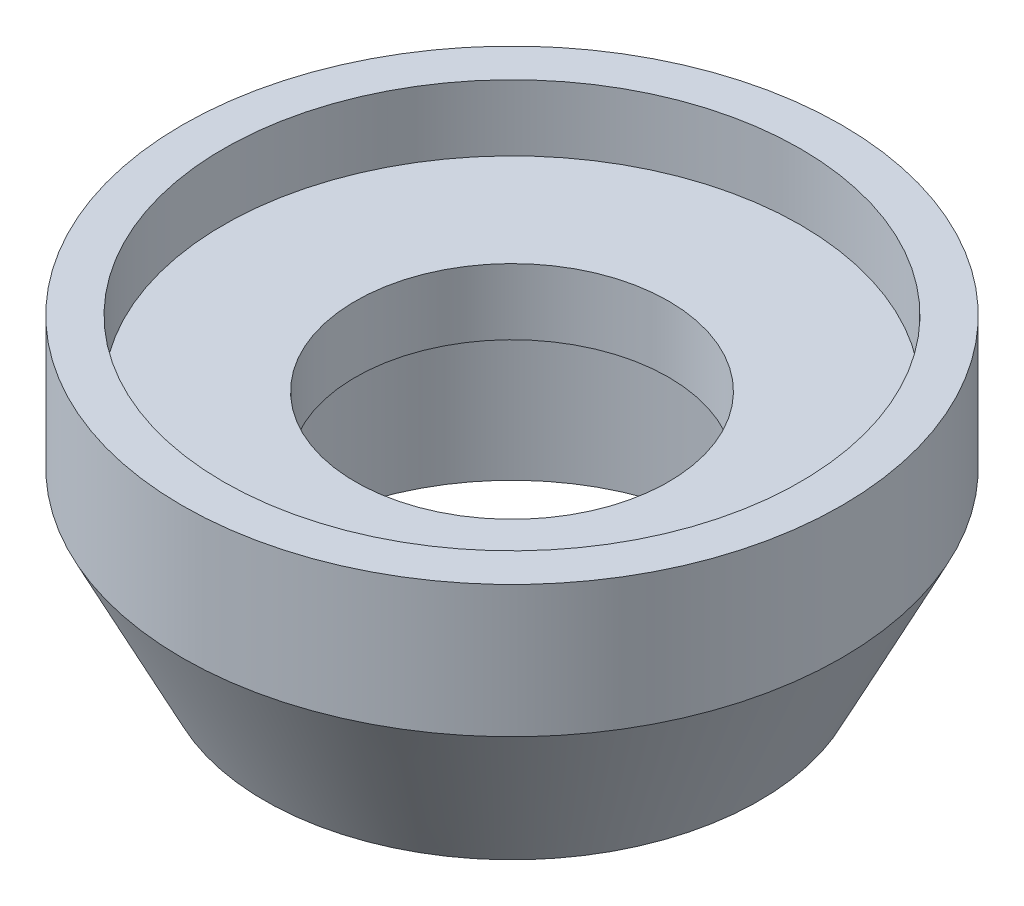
ISO-10303-21;
HEADER;
FILE_DESCRIPTION(('STEP AP214'),'2;1');
FILE_NAME('part.step','',(''),(''),'','','');
FILE_SCHEMA(('AUTOMOTIVE_DESIGN { 1 0 10303 214 1 1 1 1 }'));
ENDSEC;
DATA;
#1=APPLICATION_CONTEXT('core data for automotive mechanical design processes');
#2=APPLICATION_PROTOCOL_DEFINITION('international standard','automotive_design',2000,#1);
#3=PRODUCT_CONTEXT('',#1,'mechanical');
#4=PRODUCT('Part','Part','',(#3));
#5=PRODUCT_RELATED_PRODUCT_CATEGORY('part','',(#4));
#6=PRODUCT_DEFINITION_FORMATION('','',#4);
#7=PRODUCT_DEFINITION_CONTEXT('part definition',#1,'design');
#8=PRODUCT_DEFINITION('design','',#6,#7);
#9=PRODUCT_DEFINITION_SHAPE('','',#8);
#10=(LENGTH_UNIT() NAMED_UNIT(*) SI_UNIT(.MILLI.,.METRE.));
#11=(NAMED_UNIT(*) PLANE_ANGLE_UNIT() SI_UNIT($,.RADIAN.));
#12=(NAMED_UNIT(*) SI_UNIT($,.STERADIAN.) SOLID_ANGLE_UNIT());
#13=UNCERTAINTY_MEASURE_WITH_UNIT(LENGTH_MEASURE(1.E-05),#10,'distance_accuracy_value','');
#14=(GEOMETRIC_REPRESENTATION_CONTEXT(3) GLOBAL_UNCERTAINTY_ASSIGNED_CONTEXT((#13)) GLOBAL_UNIT_ASSIGNED_CONTEXT((#10,
#11,#12)) REPRESENTATION_CONTEXT('',''));
#15=CARTESIAN_POINT('',(0.,0.,0.));
#16=DIRECTION('',(0.,0.,1.));
#17=DIRECTION('',(1.,0.,0.));
#18=AXIS2_PLACEMENT_3D('',#15,#16,#17);
#19=CARTESIAN_POINT('',(-15.,7.67703485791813,0.));
#20=DIRECTION('',(0.,1.,0.));
#21=DIRECTION('',(0.,0.,1.));
#22=AXIS2_PLACEMENT_3D('',#19,#20,#21);
#23=PLANE('',#22);
#24=CARTESIAN_POINT('',(0.,7.67703485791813,0.));
#25=DIRECTION('',(0.,-1.,0.));
#26=DIRECTION('',(0.,0.,-1.));
#27=AXIS2_PLACEMENT_3D('',#24,#25,#26);
#28=CIRCLE('',#27,13.2);
#29=CARTESIAN_POINT('',(0.,7.67703485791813,-13.2));
#30=VERTEX_POINT('',#29);
#31=EDGE_CURVE('E10',#30,#30,#28,.T.);
#32=ORIENTED_EDGE('',*,*,#31,.F.);
#33=EDGE_LOOP('',(#32));
#34=FACE_BOUND('',#33,.T.);
#35=CARTESIAN_POINT('',(0.,7.67703485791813,0.));
#36=DIRECTION('',(0.,-1.,0.));
#37=DIRECTION('',(0.,0.,-1.));
#38=AXIS2_PLACEMENT_3D('',#35,#36,#37);
#39=CIRCLE('',#38,15.);
#40=CARTESIAN_POINT('',(0.,7.67703485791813,-15.));
#41=VERTEX_POINT('',#40);
#42=EDGE_CURVE('E62',#41,#41,#39,.T.);
#43=ORIENTED_EDGE('',*,*,#42,.T.);
#44=EDGE_LOOP('',(#43));
#45=FACE_BOUND('',#44,.T.);
#46=ADVANCED_FACE('F31',(#34,#45),#23,.F.);
#47=CARTESIAN_POINT('',(0.,0.,0.));
#48=DIRECTION('',(0.,-1.,0.));
#49=DIRECTION('',(0.,0.,-1.));
#50=AXIS2_PLACEMENT_3D('',#47,#48,#49);
#51=CYLINDRICAL_SURFACE('',#50,13.2);
#52=CARTESIAN_POINT('',(0.,17.6770348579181,0.));
#53=DIRECTION('',(0.,-1.,0.));
#54=DIRECTION('',(0.,0.,-1.));
#55=AXIS2_PLACEMENT_3D('',#52,#53,#54);
#56=CIRCLE('',#55,13.2);
#57=CARTESIAN_POINT('',(0.,17.6770348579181,-13.2));
#58=VERTEX_POINT('',#57);
#59=EDGE_CURVE('E37',#58,#58,#56,.T.);
#60=ORIENTED_EDGE('',*,*,#59,.F.);
#61=EDGE_LOOP('',(#60));
#62=FACE_BOUND('',#61,.T.);
#63=ORIENTED_EDGE('',*,*,#31,.T.);
#64=EDGE_LOOP('',(#63));
#65=FACE_BOUND('',#64,.T.);
#66=ADVANCED_FACE('F105',(#62,#65),#51,.F.);
#67=CARTESIAN_POINT('',(-13.2,17.6770348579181,0.));
#68=DIRECTION('',(0.,1.,0.));
#69=DIRECTION('',(0.,0.,1.));
#70=AXIS2_PLACEMENT_3D('',#67,#68,#69);
#71=PLANE('',#70);
#72=CARTESIAN_POINT('',(0.,17.6770348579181,0.));
#73=DIRECTION('',(0.,-1.,0.));
#74=DIRECTION('',(0.,0.,-1.));
#75=AXIS2_PLACEMENT_3D('',#72,#73,#74);
#76=CIRCLE('',#75,9.5);
#77=CARTESIAN_POINT('',(0.,17.6770348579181,-9.5));
#78=VERTEX_POINT('',#77);
#79=EDGE_CURVE('E41',#78,#78,#76,.T.);
#80=ORIENTED_EDGE('',*,*,#79,.F.);
#81=EDGE_LOOP('',(#80));
#82=FACE_BOUND('',#81,.T.);
#83=ORIENTED_EDGE('',*,*,#59,.T.);
#84=EDGE_LOOP('',(#83));
#85=FACE_BOUND('',#84,.T.);
#86=ADVANCED_FACE('F100',(#82,#85),#71,.F.);
#87=CARTESIAN_POINT('',(0.,0.,0.));
#88=DIRECTION('',(0.,-1.,0.));
#89=DIRECTION('',(0.,0.,-1.));
#90=AXIS2_PLACEMENT_3D('',#87,#88,#89);
#91=CYLINDRICAL_SURFACE('',#90,9.5);
#92=CARTESIAN_POINT('',(0.,21.6770348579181,0.));
#93=DIRECTION('',(0.,-1.,0.));
#94=DIRECTION('',(0.,0.,-1.));
#95=AXIS2_PLACEMENT_3D('',#92,#93,#94);
#96=CIRCLE('',#95,9.5);
#97=CARTESIAN_POINT('',(0.,21.6770348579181,-9.5));
#98=VERTEX_POINT('',#97);
#99=EDGE_CURVE('E45',#98,#98,#96,.T.);
#100=ORIENTED_EDGE('',*,*,#99,.F.);
#101=EDGE_LOOP('',(#100));
#102=FACE_BOUND('',#101,.T.);
#103=ORIENTED_EDGE('',*,*,#79,.T.);
#104=EDGE_LOOP('',(#103));
#105=FACE_BOUND('',#104,.T.);
#106=ADVANCED_FACE('F94',(#102,#105),#91,.F.);
#107=CARTESIAN_POINT('',(-9.5,21.6770348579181,0.));
#108=DIRECTION('',(0.,-1.,0.));
#109=DIRECTION('',(0.,0.,-1.));
#110=AXIS2_PLACEMENT_3D('',#107,#108,#109);
#111=PLANE('',#110);
#112=CARTESIAN_POINT('',(0.,21.6770348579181,0.));
#113=DIRECTION('',(0.,-1.,0.));
#114=DIRECTION('',(0.,0.,-1.));
#115=AXIS2_PLACEMENT_3D('',#112,#113,#114);
#116=CIRCLE('',#115,17.5);
#117=CARTESIAN_POINT('',(0.,21.6770348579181,-17.5));
#118=VERTEX_POINT('',#117);
#119=EDGE_CURVE('E50',#118,#118,#116,.T.);
#120=ORIENTED_EDGE('',*,*,#119,.F.);
#121=EDGE_LOOP('',(#120));
#122=FACE_BOUND('',#121,.T.);
#123=ORIENTED_EDGE('',*,*,#99,.T.);
#124=EDGE_LOOP('',(#123));
#125=FACE_BOUND('',#124,.T.);
#126=ADVANCED_FACE('F88',(#122,#125),#111,.F.);
#127=CARTESIAN_POINT('',(0.,0.,0.));
#128=DIRECTION('',(0.,-1.,0.));
#129=DIRECTION('',(0.,0.,-1.));
#130=AXIS2_PLACEMENT_3D('',#127,#128,#129);
#131=CYLINDRICAL_SURFACE('',#130,17.5);
#132=CARTESIAN_POINT('',(0.,25.6770348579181,0.));
#133=DIRECTION('',(0.,-1.,0.));
#134=DIRECTION('',(0.,0.,-1.));
#135=AXIS2_PLACEMENT_3D('',#132,#133,#134);
#136=CIRCLE('',#135,17.5);
#137=CARTESIAN_POINT('',(0.,25.6770348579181,-17.5));
#138=VERTEX_POINT('',#137);
#139=EDGE_CURVE('E53',#138,#138,#136,.T.);
#140=ORIENTED_EDGE('',*,*,#139,.F.);
#141=EDGE_LOOP('',(#140));
#142=FACE_BOUND('',#141,.T.);
#143=ORIENTED_EDGE('',*,*,#119,.T.);
#144=EDGE_LOOP('',(#143));
#145=FACE_BOUND('',#144,.T.);
#146=ADVANCED_FACE('F82',(#142,#145),#131,.F.);
#147=CARTESIAN_POINT('',(-17.5,25.6770348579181,0.));
#148=DIRECTION('',(0.,-1.,0.));
#149=DIRECTION('',(0.,0.,-1.));
#150=AXIS2_PLACEMENT_3D('',#147,#148,#149);
#151=PLANE('',#150);
#152=CARTESIAN_POINT('',(0.,25.6770348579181,0.));
#153=DIRECTION('',(0.,-1.,0.));
#154=DIRECTION('',(0.,0.,-1.));
#155=AXIS2_PLACEMENT_3D('',#152,#153,#154);
#156=CIRCLE('',#155,20.);
#157=CARTESIAN_POINT('',(0.,25.6770348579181,-20.));
#158=VERTEX_POINT('',#157);
#159=EDGE_CURVE('E56',#158,#158,#156,.T.);
#160=ORIENTED_EDGE('',*,*,#159,.F.);
#161=EDGE_LOOP('',(#160));
#162=FACE_BOUND('',#161,.T.);
#163=ORIENTED_EDGE('',*,*,#139,.T.);
#164=EDGE_LOOP('',(#163));
#165=FACE_BOUND('',#164,.T.);
#166=ADVANCED_FACE('F76',(#162,#165),#151,.F.);
#167=CARTESIAN_POINT('',(0.,0.,0.));
#168=DIRECTION('',(0.,-1.,0.));
#169=DIRECTION('',(0.,0.,-1.));
#170=AXIS2_PLACEMENT_3D('',#167,#168,#169);
#171=CYLINDRICAL_SURFACE('',#170,20.);
#172=CARTESIAN_POINT('',(0.,17.6770348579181,0.));
#173=DIRECTION('',(0.,-1.,0.));
#174=DIRECTION('',(0.,0.,-1.));
#175=AXIS2_PLACEMENT_3D('',#172,#173,#174);
#176=CIRCLE('',#175,20.);
#177=CARTESIAN_POINT('',(0.,17.6770348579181,-20.));
#178=VERTEX_POINT('',#177);
#179=EDGE_CURVE('E59',#178,#178,#176,.T.);
#180=ORIENTED_EDGE('',*,*,#179,.F.);
#181=EDGE_LOOP('',(#180));
#182=FACE_BOUND('',#181,.T.);
#183=ORIENTED_EDGE('',*,*,#159,.T.);
#184=EDGE_LOOP('',(#183));
#185=FACE_BOUND('',#184,.T.);
#186=ADVANCED_FACE('F70',(#182,#185),#171,.T.);
#187=CARTESIAN_POINT('',(0.,17.6770348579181,0.));
#188=DIRECTION('',(0.,1.,0.));
#189=DIRECTION('',(0.,0.,1.));
#190=AXIS2_PLACEMENT_3D('',#187,#188,#189);
#191=CONICAL_SURFACE('',#190,20.,0.463647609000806);
#192=ORIENTED_EDGE('',*,*,#42,.F.);
#193=EDGE_LOOP('',(#192));
#194=FACE_BOUND('',#193,.T.);
#195=ORIENTED_EDGE('',*,*,#179,.T.);
#196=EDGE_LOOP('',(#195));
#197=FACE_BOUND('',#196,.T.);
#198=ADVANCED_FACE('F67',(#194,#197),#191,.T.);
#199=CLOSED_SHELL('',(#46,#66,#86,#106,#126,#146,#166,#186,#198));
#200=MANIFOLD_SOLID_BREP('B2',#199);
#201=ADVANCED_BREP_SHAPE_REPRESENTATION('',(#18,#200),#14);
#202=SHAPE_DEFINITION_REPRESENTATION(#9,#201);
ENDSEC;
END-ISO-10303-21;
